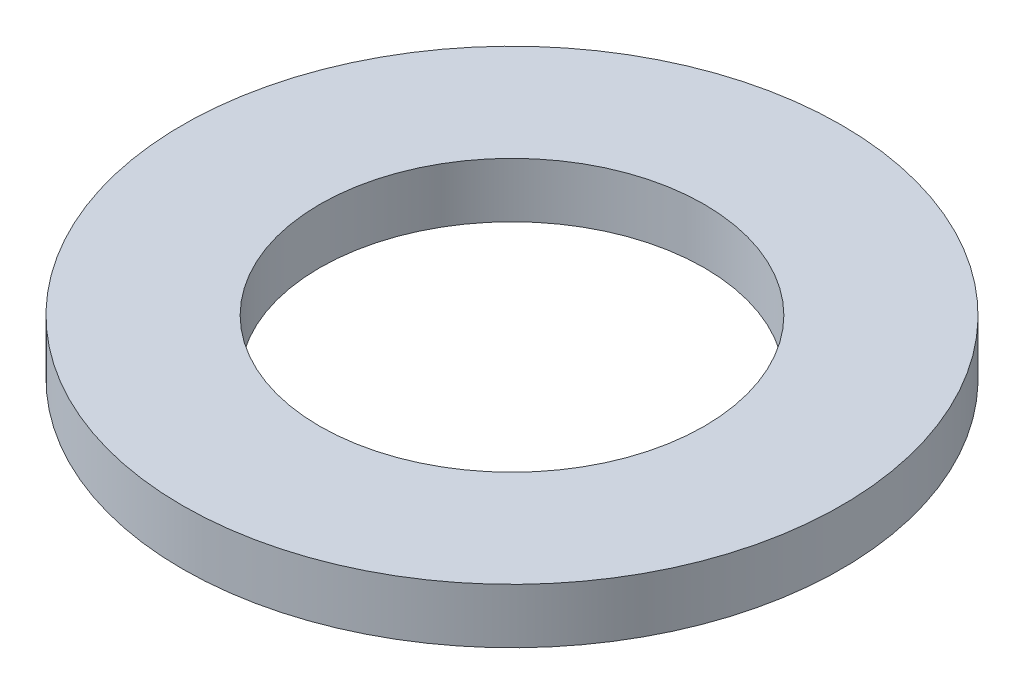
ISO-10303-21;
HEADER;
FILE_DESCRIPTION(('STEP AP214'),'2;1');
FILE_NAME('part.step','',(''),(''),'','','');
FILE_SCHEMA(('AUTOMOTIVE_DESIGN { 1 0 10303 214 1 1 1 1 }'));
ENDSEC;
DATA;
#1=APPLICATION_CONTEXT('core data for automotive mechanical design processes');
#2=APPLICATION_PROTOCOL_DEFINITION('international standard','automotive_design',2000,#1);
#3=PRODUCT_CONTEXT('',#1,'mechanical');
#4=PRODUCT('Part','Part','',(#3));
#5=PRODUCT_RELATED_PRODUCT_CATEGORY('part','',(#4));
#6=PRODUCT_DEFINITION_FORMATION('','',#4);
#7=PRODUCT_DEFINITION_CONTEXT('part definition',#1,'design');
#8=PRODUCT_DEFINITION('design','',#6,#7);
#9=PRODUCT_DEFINITION_SHAPE('','',#8);
#10=(LENGTH_UNIT() NAMED_UNIT(*) SI_UNIT(.MILLI.,.METRE.));
#11=(NAMED_UNIT(*) PLANE_ANGLE_UNIT() SI_UNIT($,.RADIAN.));
#12=(NAMED_UNIT(*) SI_UNIT($,.STERADIAN.) SOLID_ANGLE_UNIT());
#13=UNCERTAINTY_MEASURE_WITH_UNIT(LENGTH_MEASURE(1.E-05),#10,'distance_accuracy_value','');
#14=(GEOMETRIC_REPRESENTATION_CONTEXT(3) GLOBAL_UNCERTAINTY_ASSIGNED_CONTEXT((#13)) GLOBAL_UNIT_ASSIGNED_CONTEXT((#10,
#11,#12)) REPRESENTATION_CONTEXT('',''));
#15=CARTESIAN_POINT('',(0.,0.,0.));
#16=DIRECTION('',(0.,0.,1.));
#17=DIRECTION('',(1.,0.,0.));
#18=AXIS2_PLACEMENT_3D('',#15,#16,#17);
#19=CARTESIAN_POINT('',(0.,10.,0.));
#20=DIRECTION('',(0.,1.,0.));
#21=DIRECTION('',(0.,0.,1.));
#22=AXIS2_PLACEMENT_3D('',#19,#20,#21);
#23=PLANE('',#22);
#24=CARTESIAN_POINT('',(0.,10.,0.));
#25=DIRECTION('',(0.,1.,0.));
#26=DIRECTION('',(0.,0.,1.));
#27=AXIS2_PLACEMENT_3D('',#24,#25,#26);
#28=CIRCLE('',#27,60.);
#29=CARTESIAN_POINT('',(0.,10.,60.));
#30=VERTEX_POINT('',#29);
#31=EDGE_CURVE('E10',#30,#30,#28,.T.);
#32=ORIENTED_EDGE('',*,*,#31,.T.);
#33=EDGE_LOOP('',(#32));
#34=FACE_BOUND('',#33,.T.);
#35=CARTESIAN_POINT('',(0.,10.,0.));
#36=DIRECTION('',(0.,1.,0.));
#37=DIRECTION('',(0.,0.,1.));
#38=AXIS2_PLACEMENT_3D('',#35,#36,#37);
#39=CIRCLE('',#38,35.);
#40=CARTESIAN_POINT('',(0.,10.,35.));
#41=VERTEX_POINT('',#40);
#42=EDGE_CURVE('E39',#41,#41,#39,.T.);
#43=ORIENTED_EDGE('',*,*,#42,.F.);
#44=EDGE_LOOP('',(#43));
#45=FACE_BOUND('',#44,.T.);
#46=ADVANCED_FACE('F28',(#34,#45),#23,.T.);
#47=CARTESIAN_POINT('',(0.,0.,0.));
#48=DIRECTION('',(0.,1.,0.));
#49=DIRECTION('',(0.,0.,1.));
#50=AXIS2_PLACEMENT_3D('',#47,#48,#49);
#51=PLANE('',#50);
#52=CARTESIAN_POINT('',(0.,0.,0.));
#53=DIRECTION('',(0.,1.,0.));
#54=DIRECTION('',(0.,0.,1.));
#55=AXIS2_PLACEMENT_3D('',#52,#53,#54);
#56=CIRCLE('',#55,60.);
#57=CARTESIAN_POINT('',(0.,0.,60.));
#58=VERTEX_POINT('',#57);
#59=EDGE_CURVE('E35',#58,#58,#56,.T.);
#60=ORIENTED_EDGE('',*,*,#59,.F.);
#61=EDGE_LOOP('',(#60));
#62=FACE_BOUND('',#61,.T.);
#63=CARTESIAN_POINT('',(0.,0.,0.));
#64=DIRECTION('',(0.,1.,0.));
#65=DIRECTION('',(0.,0.,1.));
#66=AXIS2_PLACEMENT_3D('',#63,#64,#65);
#67=CIRCLE('',#66,35.);
#68=CARTESIAN_POINT('',(0.,0.,35.));
#69=VERTEX_POINT('',#68);
#70=EDGE_CURVE('E43',#69,#69,#67,.T.);
#71=ORIENTED_EDGE('',*,*,#70,.T.);
#72=EDGE_LOOP('',(#71));
#73=FACE_BOUND('',#72,.T.);
#74=ADVANCED_FACE('F49',(#62,#73),#51,.F.);
#75=CARTESIAN_POINT('',(0.,10.,0.));
#76=DIRECTION('',(0.,-1.,0.));
#77=DIRECTION('',(0.,0.,-1.));
#78=AXIS2_PLACEMENT_3D('',#75,#76,#77);
#79=CYLINDRICAL_SURFACE('',#78,60.);
#80=ORIENTED_EDGE('',*,*,#31,.F.);
#81=EDGE_LOOP('',(#80));
#82=FACE_BOUND('',#81,.T.);
#83=ORIENTED_EDGE('',*,*,#59,.T.);
#84=EDGE_LOOP('',(#83));
#85=FACE_BOUND('',#84,.T.);
#86=ADVANCED_FACE('F30',(#82,#85),#79,.T.);
#87=CARTESIAN_POINT('',(0.,10.,0.));
#88=DIRECTION('',(0.,-1.,0.));
#89=DIRECTION('',(0.,0.,-1.));
#90=AXIS2_PLACEMENT_3D('',#87,#88,#89);
#91=CYLINDRICAL_SURFACE('',#90,35.);
#92=ORIENTED_EDGE('',*,*,#42,.T.);
#93=EDGE_LOOP('',(#92));
#94=FACE_BOUND('',#93,.T.);
#95=ORIENTED_EDGE('',*,*,#70,.F.);
#96=EDGE_LOOP('',(#95));
#97=FACE_BOUND('',#96,.T.);
#98=ADVANCED_FACE('F51',(#94,#97),#91,.F.);
#99=CLOSED_SHELL('',(#46,#74,#86,#98));
#100=MANIFOLD_SOLID_BREP('B2',#99);
#101=ADVANCED_BREP_SHAPE_REPRESENTATION('',(#18,#100),#14);
#102=SHAPE_DEFINITION_REPRESENTATION(#9,#101);
ENDSEC;
END-ISO-10303-21;
